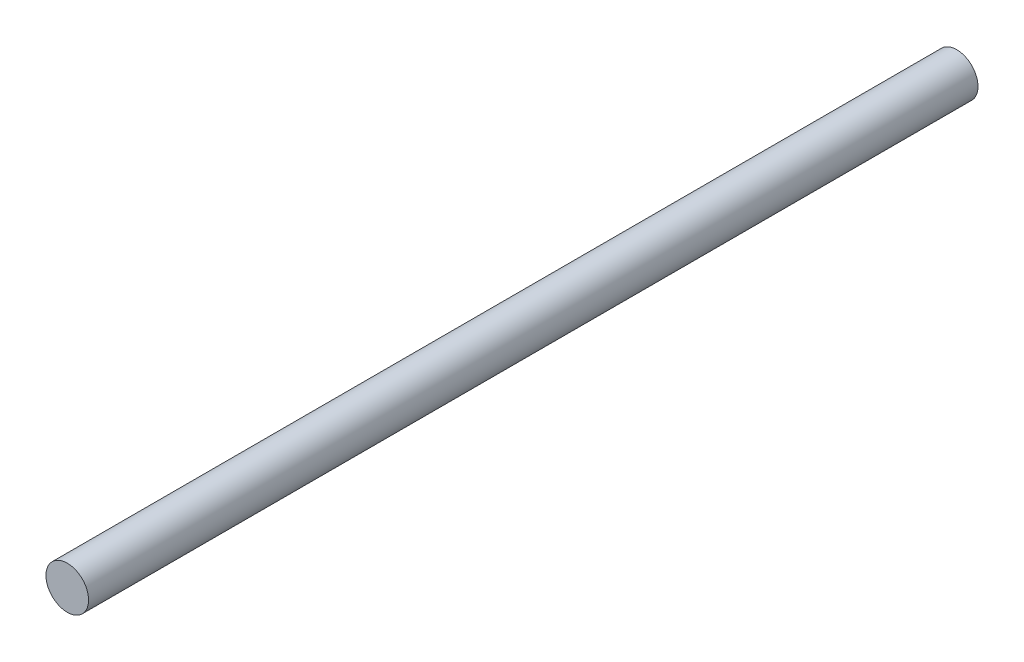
ISO-10303-21;
HEADER;
FILE_DESCRIPTION(('STEP AP214'),'2;1');
FILE_NAME('part.step','',(''),(''),'','','');
FILE_SCHEMA(('AUTOMOTIVE_DESIGN { 1 0 10303 214 1 1 1 1 }'));
ENDSEC;
DATA;
#1=APPLICATION_CONTEXT('core data for automotive mechanical design processes');
#2=APPLICATION_PROTOCOL_DEFINITION('international standard','automotive_design',2000,#1);
#3=PRODUCT_CONTEXT('',#1,'mechanical');
#4=PRODUCT('Part','Part','',(#3));
#5=PRODUCT_RELATED_PRODUCT_CATEGORY('part','',(#4));
#6=PRODUCT_DEFINITION_FORMATION('','',#4);
#7=PRODUCT_DEFINITION_CONTEXT('part definition',#1,'design');
#8=PRODUCT_DEFINITION('design','',#6,#7);
#9=PRODUCT_DEFINITION_SHAPE('','',#8);
#10=(LENGTH_UNIT() NAMED_UNIT(*) SI_UNIT(.MILLI.,.METRE.));
#11=(NAMED_UNIT(*) PLANE_ANGLE_UNIT() SI_UNIT($,.RADIAN.));
#12=(NAMED_UNIT(*) SI_UNIT($,.STERADIAN.) SOLID_ANGLE_UNIT());
#13=UNCERTAINTY_MEASURE_WITH_UNIT(LENGTH_MEASURE(1.E-05),#10,'distance_accuracy_value','');
#14=(GEOMETRIC_REPRESENTATION_CONTEXT(3) GLOBAL_UNCERTAINTY_ASSIGNED_CONTEXT((#13)) GLOBAL_UNIT_ASSIGNED_CONTEXT((#10,
#11,#12)) REPRESENTATION_CONTEXT('',''));
#15=CARTESIAN_POINT('',(0.,0.,0.));
#16=DIRECTION('',(0.,0.,1.));
#17=DIRECTION('',(1.,0.,0.));
#18=AXIS2_PLACEMENT_3D('',#15,#16,#17);
#19=CARTESIAN_POINT('',(0.,0.,381.));
#20=DIRECTION('',(0.,0.,-1.));
#21=DIRECTION('',(-1.,0.,0.));
#22=AXIS2_PLACEMENT_3D('',#19,#20,#21);
#23=CYLINDRICAL_SURFACE('',#22,18.25625);
#24=CARTESIAN_POINT('',(0.,0.,381.));
#25=DIRECTION('',(0.,0.,1.));
#26=DIRECTION('',(1.,0.,0.));
#27=AXIS2_PLACEMENT_3D('',#24,#25,#26);
#28=CIRCLE('',#27,18.25625);
#29=CARTESIAN_POINT('',(18.25625,0.,381.));
#30=VERTEX_POINT('',#29);
#31=EDGE_CURVE('E10',#30,#30,#28,.T.);
#32=ORIENTED_EDGE('',*,*,#31,.F.);
#33=EDGE_LOOP('',(#32));
#34=FACE_BOUND('',#33,.T.);
#35=CARTESIAN_POINT('',(0.,0.,-381.));
#36=DIRECTION('',(0.,0.,1.));
#37=DIRECTION('',(1.,0.,0.));
#38=AXIS2_PLACEMENT_3D('',#35,#36,#37);
#39=CIRCLE('',#38,18.25625);
#40=CARTESIAN_POINT('',(18.25625,0.,-381.));
#41=VERTEX_POINT('',#40);
#42=EDGE_CURVE('E38',#41,#41,#39,.T.);
#43=ORIENTED_EDGE('',*,*,#42,.T.);
#44=EDGE_LOOP('',(#43));
#45=FACE_BOUND('',#44,.T.);
#46=ADVANCED_FACE('F32',(#34,#45),#23,.T.);
#47=CARTESIAN_POINT('',(0.,0.,381.));
#48=DIRECTION('',(0.,0.,1.));
#49=DIRECTION('',(1.,0.,0.));
#50=AXIS2_PLACEMENT_3D('',#47,#48,#49);
#51=PLANE('',#50);
#52=ORIENTED_EDGE('',*,*,#31,.T.);
#53=EDGE_LOOP('',(#52));
#54=FACE_BOUND('',#53,.T.);
#55=ADVANCED_FACE('F47',(#54),#51,.T.);
#56=CARTESIAN_POINT('',(0.,0.,-381.));
#57=DIRECTION('',(0.,0.,1.));
#58=DIRECTION('',(1.,0.,0.));
#59=AXIS2_PLACEMENT_3D('',#56,#57,#58);
#60=PLANE('',#59);
#61=ORIENTED_EDGE('',*,*,#42,.F.);
#62=EDGE_LOOP('',(#61));
#63=FACE_BOUND('',#62,.T.);
#64=ADVANCED_FACE('F45',(#63),#60,.F.);
#65=CLOSED_SHELL('',(#46,#55,#64));
#66=MANIFOLD_SOLID_BREP('B2',#65);
#67=ADVANCED_BREP_SHAPE_REPRESENTATION('',(#18,#66),#14);
#68=SHAPE_DEFINITION_REPRESENTATION(#9,#67);
ENDSEC;
END-ISO-10303-21;
